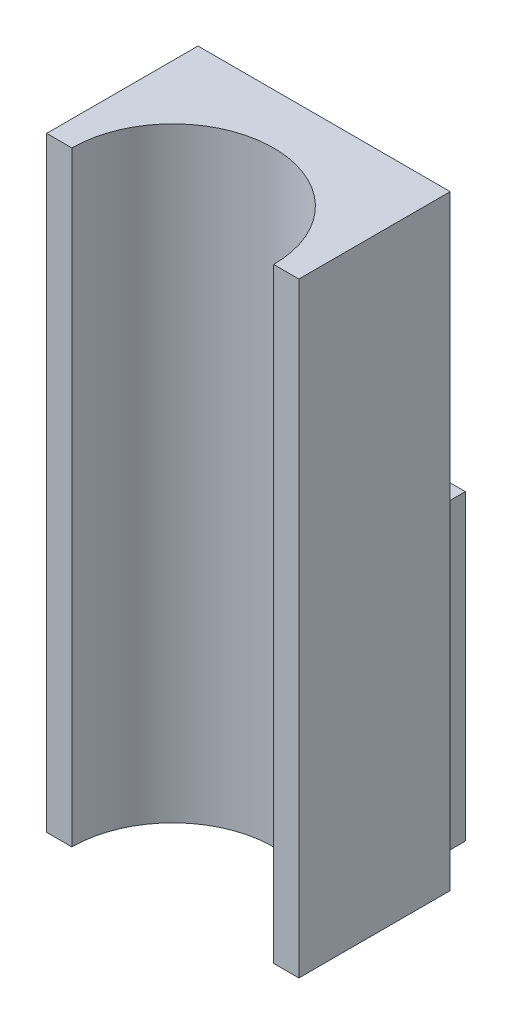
from build123d import *

# Parameters (mm, degrees)
SKETCH1_W           = 7.2
SKETCH1_H           = 12
BOSS_EXTRUDE1_DEPTH = 2
SKETCH2_W           = 10
SKETCH2_H           = 24
BOSS_EXTRUDE2_DEPTH = 6
CUT_EXTRUDE1_DEPTH  = 24


with BuildPart() as part:
    # Sketch1 → Boss-Extrude1 (new body)
    with BuildSketch(Plane.XY):
        Rectangle(SKETCH1_W, SKETCH1_H)
    extrude(amount=BOSS_EXTRUDE1_DEPTH)

    # Sketch2 → Boss-Extrude2 (add)
    with BuildSketch(Plane.XY.offset(2)):
        with Locations((0, 6)):
            Rectangle(SKETCH2_W, SKETCH2_H)
    extrude(amount=BOSS_EXTRUDE2_DEPTH)

    # Sketch5 → Cut-Extrude1 (cut)
    with BuildSketch(Plane(origin=(0, 18, 0), x_dir=(1, 0, 0), z_dir=(0, 1, 0))):
        with BuildLine():
            Line((-4, -8), (4, -8))
            ThreePointArc((4, -8), (0, -4), (-4, -8))
        make_face()
    extrude(amount=-CUT_EXTRUDE1_DEPTH, mode=Mode.SUBTRACT)


solid = part.part
